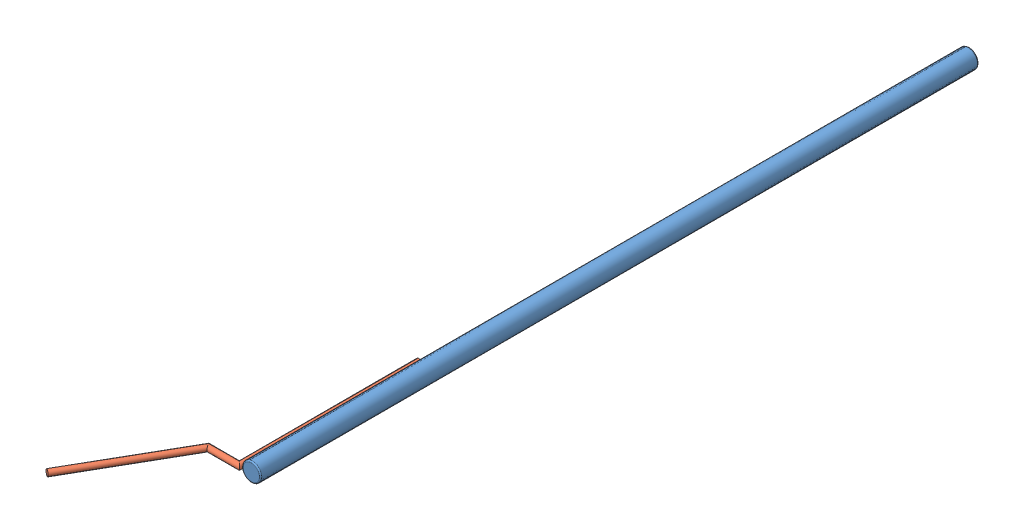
SolidWorks assembly Launcher.SLDASM, configuration Default (file format 5000). Lengths in mm.
Overall size (48.23 7.94 348.95).
2 component instances, 2 part files, 3 mates.
Components (placement in the parent):
- Launcher Shaft-2: Launcher Shaft.SLDPRT [Default] at origin size (7.94 7.94 304.8)
- Launcher Wire-1: Launcher Wire.SLDPRT [Default] at (-5 0 -76.1267) x (0 0 -1) z (0 1 0) size (120.28 40.53 2.54)
Mates (geometry in assembly coordinates):
- Distance3: distance = 5 mm anti-aligned: plane of Launcher Shaft-2; plane of Launcher Wire-1
- Coincident6: coincident aligned: plane of Launcher Shaft-2; plane of Launcher Wire-1
- Distance4: distance = 76.1267 mm anti-aligned: plane of Launcher Shaft-2 through (0 0 0) normal (0 0 1); plane of Launcher Wire-1 through (-5 0 -76.1267) normal (0 0 -1)
